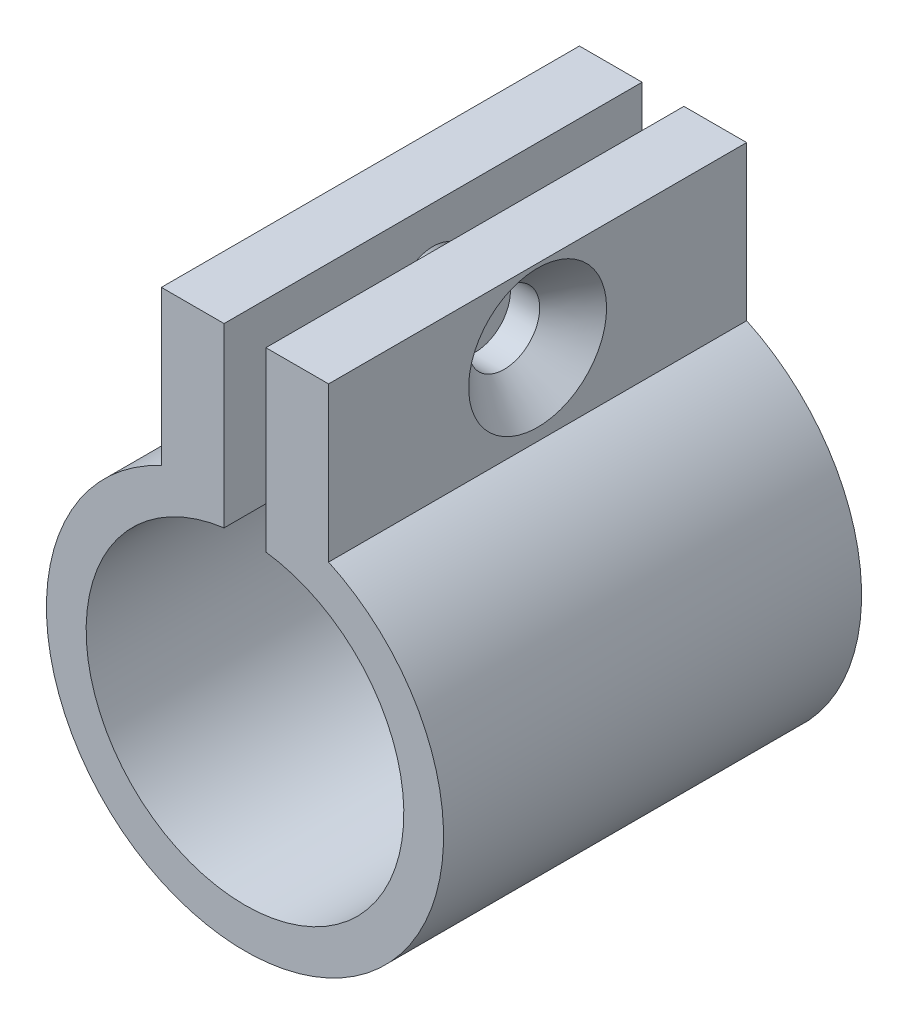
ISO-10303-21;
HEADER;
FILE_DESCRIPTION(('STEP AP214'),'2;1');
FILE_NAME('part.step','',(''),(''),'','','');
FILE_SCHEMA(('AUTOMOTIVE_DESIGN { 1 0 10303 214 1 1 1 1 }'));
ENDSEC;
DATA;
#1=APPLICATION_CONTEXT('core data for automotive mechanical design processes');
#2=APPLICATION_PROTOCOL_DEFINITION('international standard','automotive_design',2000,#1);
#3=PRODUCT_CONTEXT('',#1,'mechanical');
#4=PRODUCT('Part','Part','',(#3));
#5=PRODUCT_RELATED_PRODUCT_CATEGORY('part','',(#4));
#6=PRODUCT_DEFINITION_FORMATION('','',#4);
#7=PRODUCT_DEFINITION_CONTEXT('part definition',#1,'design');
#8=PRODUCT_DEFINITION('design','',#6,#7);
#9=PRODUCT_DEFINITION_SHAPE('','',#8);
#10=(LENGTH_UNIT() NAMED_UNIT(*) SI_UNIT(.MILLI.,.METRE.));
#11=(NAMED_UNIT(*) PLANE_ANGLE_UNIT() SI_UNIT($,.RADIAN.));
#12=(NAMED_UNIT(*) SI_UNIT($,.STERADIAN.) SOLID_ANGLE_UNIT());
#13=UNCERTAINTY_MEASURE_WITH_UNIT(LENGTH_MEASURE(1.E-05),#10,'distance_accuracy_value','');
#14=(GEOMETRIC_REPRESENTATION_CONTEXT(3) GLOBAL_UNCERTAINTY_ASSIGNED_CONTEXT((#13)) GLOBAL_UNIT_ASSIGNED_CONTEXT((#10,
#11,#12)) REPRESENTATION_CONTEXT('',''));
#15=CARTESIAN_POINT('',(0.,0.,0.));
#16=DIRECTION('',(0.,0.,1.));
#17=DIRECTION('',(1.,0.,0.));
#18=AXIS2_PLACEMENT_3D('',#15,#16,#17);
#19=CARTESIAN_POINT('',(0.,0.,20.));
#20=DIRECTION('',(0.,0.,1.));
#21=DIRECTION('',(1.,0.,0.));
#22=AXIS2_PLACEMENT_3D('',#19,#20,#21);
#23=PLANE('',#22);
#24=DIRECTION('',(0.,1.,0.));
#25=VECTOR('',#24,1.);
#26=CARTESIAN_POINT('',(4.,6.4621977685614,20.));
#27=LINE('',#26,#25);
#28=CARTESIAN_POINT('',(4.,8.61684396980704,20.));
#29=VERTEX_POINT('',#28);
#30=CARTESIAN_POINT('',(4.,16.,20.));
#31=VERTEX_POINT('',#30);
#32=EDGE_CURVE('E114',#29,#31,#27,.T.);
#33=ORIENTED_EDGE('',*,*,#32,.T.);
#34=DIRECTION('',(-1.,0.,0.));
#35=VECTOR('',#34,1.);
#36=CARTESIAN_POINT('',(0.,16.,20.));
#37=LINE('',#36,#35);
#38=CARTESIAN_POINT('',(1.,16.,20.));
#39=VERTEX_POINT('',#38);
#40=EDGE_CURVE('E102',#31,#39,#37,.T.);
#41=ORIENTED_EDGE('',*,*,#40,.T.);
#42=DIRECTION('',(0.,1.,0.));
#43=VECTOR('',#42,1.);
#44=CARTESIAN_POINT('',(1.,7.53392328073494,20.));
#45=LINE('',#44,#43);
#46=CARTESIAN_POINT('',(1.,7.53392328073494,20.));
#47=VERTEX_POINT('',#46);
#48=EDGE_CURVE('E111',#47,#39,#45,.T.);
#49=ORIENTED_EDGE('',*,*,#48,.F.);
#50=CARTESIAN_POINT('',(0.,0.,20.));
#51=DIRECTION('',(0.,0.,1.));
#52=DIRECTION('',(1.,0.,0.));
#53=AXIS2_PLACEMENT_3D('',#50,#51,#52);
#54=CIRCLE('',#53,7.6);
#55=CARTESIAN_POINT('',(-1.,7.53392328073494,20.));
#56=VERTEX_POINT('',#55);
#57=EDGE_CURVE('E151',#56,#47,#54,.T.);
#58=ORIENTED_EDGE('',*,*,#57,.F.);
#59=DIRECTION('',(0.,-1.,0.));
#60=VECTOR('',#59,1.);
#61=CARTESIAN_POINT('',(-1.,7.53392328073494,20.));
#62=LINE('',#61,#60);
#63=CARTESIAN_POINT('',(-1.,16.,20.));
#64=VERTEX_POINT('',#63);
#65=EDGE_CURVE('E120',#64,#56,#62,.T.);
#66=ORIENTED_EDGE('',*,*,#65,.F.);
#67=CARTESIAN_POINT('',(-4.,16.,20.));
#68=VERTEX_POINT('',#67);
#69=EDGE_CURVE('E54',#64,#68,#37,.T.);
#70=ORIENTED_EDGE('',*,*,#69,.T.);
#71=DIRECTION('',(0.,-1.,0.));
#72=VECTOR('',#71,1.);
#73=CARTESIAN_POINT('',(-4.,6.46219776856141,20.));
#74=LINE('',#73,#72);
#75=CARTESIAN_POINT('',(-4.,8.61684396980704,20.));
#76=VERTEX_POINT('',#75);
#77=EDGE_CURVE('E140',#68,#76,#74,.T.);
#78=ORIENTED_EDGE('',*,*,#77,.T.);
#79=CARTESIAN_POINT('',(0.,0.,20.));
#80=DIRECTION('',(0.,0.,1.));
#81=DIRECTION('',(1.,0.,0.));
#82=AXIS2_PLACEMENT_3D('',#79,#80,#81);
#83=CIRCLE('',#82,9.5);
#84=EDGE_CURVE('E47',#76,#29,#83,.T.);
#85=ORIENTED_EDGE('',*,*,#84,.T.);
#86=EDGE_LOOP('',(#33,#41,#49,#58,#66,#70,#78,#85));
#87=FACE_BOUND('',#86,.T.);
#88=ADVANCED_FACE('F39',(#87),#23,.T.);
#89=CARTESIAN_POINT('',(0.,0.,0.));
#90=DIRECTION('',(0.,0.,1.));
#91=DIRECTION('',(1.,0.,0.));
#92=AXIS2_PLACEMENT_3D('',#89,#90,#91);
#93=PLANE('',#92);
#94=DIRECTION('',(-1.,0.,0.));
#95=VECTOR('',#94,1.);
#96=CARTESIAN_POINT('',(0.,16.,0.));
#97=LINE('',#96,#95);
#98=CARTESIAN_POINT('',(4.,16.,0.));
#99=VERTEX_POINT('',#98);
#100=CARTESIAN_POINT('',(1.,16.,0.));
#101=VERTEX_POINT('',#100);
#102=EDGE_CURVE('E61',#99,#101,#97,.T.);
#103=ORIENTED_EDGE('',*,*,#102,.F.);
#104=DIRECTION('',(0.,1.,0.));
#105=VECTOR('',#104,1.);
#106=CARTESIAN_POINT('',(4.,6.4621977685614,0.));
#107=LINE('',#106,#105);
#108=CARTESIAN_POINT('',(4.,8.61684396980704,0.));
#109=VERTEX_POINT('',#108);
#110=EDGE_CURVE('E136',#109,#99,#107,.T.);
#111=ORIENTED_EDGE('',*,*,#110,.F.);
#112=CARTESIAN_POINT('',(0.,0.,0.));
#113=DIRECTION('',(0.,0.,1.));
#114=DIRECTION('',(1.,0.,0.));
#115=AXIS2_PLACEMENT_3D('',#112,#113,#114);
#116=CIRCLE('',#115,9.5);
#117=CARTESIAN_POINT('',(-4.,8.61684396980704,0.));
#118=VERTEX_POINT('',#117);
#119=EDGE_CURVE('E153',#118,#109,#116,.T.);
#120=ORIENTED_EDGE('',*,*,#119,.F.);
#121=DIRECTION('',(0.,-1.,0.));
#122=VECTOR('',#121,1.);
#123=CARTESIAN_POINT('',(-4.,6.46219776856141,0.));
#124=LINE('',#123,#122);
#125=CARTESIAN_POINT('',(-4.,16.,0.));
#126=VERTEX_POINT('',#125);
#127=EDGE_CURVE('E139',#126,#118,#124,.T.);
#128=ORIENTED_EDGE('',*,*,#127,.F.);
#129=CARTESIAN_POINT('',(-1.,16.,0.));
#130=VERTEX_POINT('',#129);
#131=EDGE_CURVE('E181',#130,#126,#97,.T.);
#132=ORIENTED_EDGE('',*,*,#131,.F.);
#133=DIRECTION('',(0.,-1.,0.));
#134=VECTOR('',#133,1.);
#135=CARTESIAN_POINT('',(-1.,7.53392328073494,0.));
#136=LINE('',#135,#134);
#137=CARTESIAN_POINT('',(-1.,7.53392328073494,0.));
#138=VERTEX_POINT('',#137);
#139=EDGE_CURVE('E129',#130,#138,#136,.T.);
#140=ORIENTED_EDGE('',*,*,#139,.T.);
#141=CARTESIAN_POINT('',(0.,0.,0.));
#142=DIRECTION('',(0.,0.,1.));
#143=DIRECTION('',(1.,0.,0.));
#144=AXIS2_PLACEMENT_3D('',#141,#142,#143);
#145=CIRCLE('',#144,7.6);
#146=CARTESIAN_POINT('',(1.,7.53392328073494,0.));
#147=VERTEX_POINT('',#146);
#148=EDGE_CURVE('E150',#138,#147,#145,.T.);
#149=ORIENTED_EDGE('',*,*,#148,.T.);
#150=DIRECTION('',(0.,1.,0.));
#151=VECTOR('',#150,1.);
#152=CARTESIAN_POINT('',(1.,7.53392328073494,0.));
#153=LINE('',#152,#151);
#154=EDGE_CURVE('E123',#147,#101,#153,.T.);
#155=ORIENTED_EDGE('',*,*,#154,.T.);
#156=EDGE_LOOP('',(#103,#111,#120,#128,#132,#140,#149,#155));
#157=FACE_BOUND('',#156,.T.);
#158=ADVANCED_FACE('F178',(#157),#93,.F.);
#159=CARTESIAN_POINT('',(4.,6.4621977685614,0.));
#160=DIRECTION('',(1.,0.,0.));
#161=DIRECTION('',(0.,0.,-1.));
#162=AXIS2_PLACEMENT_3D('',#159,#160,#161);
#163=PLANE('',#162);
#164=CARTESIAN_POINT('',(4.,12.5,10.));
#165=DIRECTION('',(1.,0.,0.));
#166=DIRECTION('',(0.,0.,-1.));
#167=AXIS2_PLACEMENT_3D('',#164,#165,#166);
#168=CIRCLE('',#167,3.3);
#169=CARTESIAN_POINT('',(4.,12.5,6.7));
#170=VERTEX_POINT('',#169);
#171=EDGE_CURVE('E166',#170,#170,#168,.T.);
#172=ORIENTED_EDGE('',*,*,#171,.F.);
#173=EDGE_LOOP('',(#172));
#174=FACE_BOUND('',#173,.T.);
#175=ORIENTED_EDGE('',*,*,#110,.T.);
#176=DIRECTION('',(0.,0.,1.));
#177=VECTOR('',#176,1.);
#178=CARTESIAN_POINT('',(4.,16.,0.));
#179=LINE('',#178,#177);
#180=EDGE_CURVE('E115',#99,#31,#179,.T.);
#181=ORIENTED_EDGE('',*,*,#180,.T.);
#182=ORIENTED_EDGE('',*,*,#32,.F.);
#183=DIRECTION('',(0.,0.,-1.));
#184=VECTOR('',#183,1.);
#185=CARTESIAN_POINT('',(4.,8.61684396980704,20.));
#186=LINE('',#185,#184);
#187=EDGE_CURVE('E147',#109,#29,#186,.F.);
#188=ORIENTED_EDGE('',*,*,#187,.F.);
#189=EDGE_LOOP('',(#175,#181,#182,#188));
#190=FACE_BOUND('',#189,.T.);
#191=ADVANCED_FACE('F197',(#174,#190),#163,.T.);
#192=CARTESIAN_POINT('',(-4.,6.46219776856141,0.));
#193=DIRECTION('',(-1.,0.,0.));
#194=DIRECTION('',(0.,-1.,0.));
#195=AXIS2_PLACEMENT_3D('',#192,#193,#194);
#196=PLANE('',#195);
#197=CARTESIAN_POINT('',(-4.,12.5,10.));
#198=DIRECTION('',(-1.,0.,0.));
#199=DIRECTION('',(0.,-1.,0.));
#200=AXIS2_PLACEMENT_3D('',#197,#198,#199);
#201=CIRCLE('',#200,1.7);
#202=CARTESIAN_POINT('',(-4.,10.8,10.));
#203=VERTEX_POINT('',#202);
#204=EDGE_CURVE('E121',#203,#203,#201,.T.);
#205=ORIENTED_EDGE('',*,*,#204,.F.);
#206=EDGE_LOOP('',(#205));
#207=FACE_BOUND('',#206,.T.);
#208=ORIENTED_EDGE('',*,*,#77,.F.);
#209=DIRECTION('',(0.,0.,-1.));
#210=VECTOR('',#209,1.);
#211=CARTESIAN_POINT('',(-4.,16.,0.));
#212=LINE('',#211,#210);
#213=EDGE_CURVE('E171',#68,#126,#212,.T.);
#214=ORIENTED_EDGE('',*,*,#213,.T.);
#215=ORIENTED_EDGE('',*,*,#127,.T.);
#216=DIRECTION('',(0.,0.,-1.));
#217=VECTOR('',#216,1.);
#218=CARTESIAN_POINT('',(-4.,8.61684396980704,20.));
#219=LINE('',#218,#217);
#220=EDGE_CURVE('E142',#76,#118,#219,.T.);
#221=ORIENTED_EDGE('',*,*,#220,.F.);
#222=EDGE_LOOP('',(#208,#214,#215,#221));
#223=FACE_BOUND('',#222,.T.);
#224=ADVANCED_FACE('F191',(#207,#223),#196,.T.);
#225=CARTESIAN_POINT('',(-1.,7.53392328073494,0.));
#226=DIRECTION('',(-1.,0.,0.));
#227=DIRECTION('',(0.,0.,1.));
#228=AXIS2_PLACEMENT_3D('',#225,#226,#227);
#229=PLANE('',#228);
#230=CARTESIAN_POINT('',(-1.,12.5,10.));
#231=DIRECTION('',(-1.,0.,0.));
#232=DIRECTION('',(0.,0.,1.));
#233=AXIS2_PLACEMENT_3D('',#230,#231,#232);
#234=CIRCLE('',#233,1.7);
#235=CARTESIAN_POINT('',(-1.,12.5,11.7));
#236=VERTEX_POINT('',#235);
#237=EDGE_CURVE('E126',#236,#236,#234,.T.);
#238=ORIENTED_EDGE('',*,*,#237,.T.);
#239=EDGE_LOOP('',(#238));
#240=FACE_BOUND('',#239,.T.);
#241=DIRECTION('',(0.,0.,-1.));
#242=VECTOR('',#241,1.);
#243=CARTESIAN_POINT('',(-1.,16.,0.));
#244=LINE('',#243,#242);
#245=EDGE_CURVE('E199',#64,#130,#244,.T.);
#246=ORIENTED_EDGE('',*,*,#245,.F.);
#247=ORIENTED_EDGE('',*,*,#65,.T.);
#248=DIRECTION('',(0.,0.,1.));
#249=VECTOR('',#248,1.);
#250=CARTESIAN_POINT('',(-1.,7.53392328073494,0.));
#251=LINE('',#250,#249);
#252=EDGE_CURVE('E133',#138,#56,#251,.T.);
#253=ORIENTED_EDGE('',*,*,#252,.F.);
#254=ORIENTED_EDGE('',*,*,#139,.F.);
#255=EDGE_LOOP('',(#246,#247,#253,#254));
#256=FACE_BOUND('',#255,.T.);
#257=ADVANCED_FACE('F183',(#240,#256),#229,.F.);
#258=CARTESIAN_POINT('',(1.,7.53392328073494,0.));
#259=DIRECTION('',(1.,0.,0.));
#260=DIRECTION('',(0.,0.,-1.));
#261=AXIS2_PLACEMENT_3D('',#258,#259,#260);
#262=PLANE('',#261);
#263=CARTESIAN_POINT('',(1.,12.5,10.));
#264=DIRECTION('',(1.,0.,0.));
#265=DIRECTION('',(0.,0.,-1.));
#266=AXIS2_PLACEMENT_3D('',#263,#264,#265);
#267=CIRCLE('',#266,1.7);
#268=CARTESIAN_POINT('',(1.,12.5,8.3));
#269=VERTEX_POINT('',#268);
#270=EDGE_CURVE('E158',#269,#269,#267,.T.);
#271=ORIENTED_EDGE('',*,*,#270,.T.);
#272=EDGE_LOOP('',(#271));
#273=FACE_BOUND('',#272,.T.);
#274=DIRECTION('',(0.,0.,1.));
#275=VECTOR('',#274,1.);
#276=CARTESIAN_POINT('',(1.,16.,0.));
#277=LINE('',#276,#275);
#278=EDGE_CURVE('E11',#101,#39,#277,.T.);
#279=ORIENTED_EDGE('',*,*,#278,.F.);
#280=ORIENTED_EDGE('',*,*,#154,.F.);
#281=DIRECTION('',(0.,0.,1.));
#282=VECTOR('',#281,1.);
#283=CARTESIAN_POINT('',(1.,7.53392328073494,0.));
#284=LINE('',#283,#282);
#285=EDGE_CURVE('E119',#147,#47,#284,.T.);
#286=ORIENTED_EDGE('',*,*,#285,.T.);
#287=ORIENTED_EDGE('',*,*,#48,.T.);
#288=EDGE_LOOP('',(#279,#280,#286,#287));
#289=FACE_BOUND('',#288,.T.);
#290=ADVANCED_FACE('F117',(#273,#289),#262,.F.);
#291=CARTESIAN_POINT('',(0.,0.,20.));
#292=DIRECTION('',(0.,0.,-1.));
#293=DIRECTION('',(-1.,0.,0.));
#294=AXIS2_PLACEMENT_3D('',#291,#292,#293);
#295=CYLINDRICAL_SURFACE('',#294,9.5);
#296=ORIENTED_EDGE('',*,*,#119,.T.);
#297=ORIENTED_EDGE('',*,*,#187,.T.);
#298=ORIENTED_EDGE('',*,*,#84,.F.);
#299=ORIENTED_EDGE('',*,*,#220,.T.);
#300=EDGE_LOOP('',(#296,#297,#298,#299));
#301=FACE_BOUND('',#300,.T.);
#302=ADVANCED_FACE('F41',(#301),#295,.T.);
#303=CARTESIAN_POINT('',(0.,0.,20.));
#304=DIRECTION('',(0.,0.,-1.));
#305=DIRECTION('',(-1.,0.,0.));
#306=AXIS2_PLACEMENT_3D('',#303,#304,#305);
#307=CYLINDRICAL_SURFACE('',#306,7.6);
#308=ORIENTED_EDGE('',*,*,#285,.F.);
#309=ORIENTED_EDGE('',*,*,#148,.F.);
#310=ORIENTED_EDGE('',*,*,#252,.T.);
#311=ORIENTED_EDGE('',*,*,#57,.T.);
#312=EDGE_LOOP('',(#308,#309,#310,#311));
#313=FACE_BOUND('',#312,.T.);
#314=ADVANCED_FACE('F186',(#313),#307,.F.);
#315=CARTESIAN_POINT('',(4.,12.5,10.));
#316=DIRECTION('',(1.,0.,0.));
#317=DIRECTION('',(0.,0.,-1.));
#318=AXIS2_PLACEMENT_3D('',#315,#316,#317);
#319=CYLINDRICAL_SURFACE('',#318,1.7);
#320=CARTESIAN_POINT('',(2.4,12.5,10.));
#321=DIRECTION('',(1.,0.,0.));
#322=DIRECTION('',(0.,0.,-1.));
#323=AXIS2_PLACEMENT_3D('',#320,#321,#322);
#324=CIRCLE('',#323,1.7);
#325=CARTESIAN_POINT('',(2.4,12.5,8.3));
#326=VERTEX_POINT('',#325);
#327=EDGE_CURVE('E160',#326,#326,#324,.T.);
#328=ORIENTED_EDGE('',*,*,#327,.T.);
#329=EDGE_LOOP('',(#328));
#330=FACE_BOUND('',#329,.T.);
#331=ORIENTED_EDGE('',*,*,#270,.F.);
#332=EDGE_LOOP('',(#331));
#333=FACE_BOUND('',#332,.T.);
#334=ADVANCED_FACE('F218',(#330,#333),#319,.F.);
#335=CARTESIAN_POINT('',(4.,12.5,10.));
#336=DIRECTION('',(1.,0.,0.));
#337=DIRECTION('',(0.,0.,-1.));
#338=AXIS2_PLACEMENT_3D('',#335,#336,#337);
#339=CONICAL_SURFACE('',#338,3.3,0.785398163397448);
#340=ORIENTED_EDGE('',*,*,#327,.F.);
#341=EDGE_LOOP('',(#340));
#342=FACE_BOUND('',#341,.T.);
#343=ORIENTED_EDGE('',*,*,#171,.T.);
#344=EDGE_LOOP('',(#343));
#345=FACE_BOUND('',#344,.T.);
#346=ADVANCED_FACE('F231',(#342,#345),#339,.F.);
#347=ORIENTED_EDGE('',*,*,#204,.T.);
#348=EDGE_LOOP('',(#347));
#349=FACE_BOUND('',#348,.T.);
#350=ORIENTED_EDGE('',*,*,#237,.F.);
#351=EDGE_LOOP('',(#350));
#352=FACE_BOUND('',#351,.T.);
#353=ADVANCED_FACE('F208',(#349,#352),#319,.F.);
#354=CARTESIAN_POINT('',(0.,16.,0.));
#355=DIRECTION('',(0.,1.,0.));
#356=DIRECTION('',(0.,0.,1.));
#357=AXIS2_PLACEMENT_3D('',#354,#355,#356);
#358=PLANE('',#357);
#359=ORIENTED_EDGE('',*,*,#102,.T.);
#360=ORIENTED_EDGE('',*,*,#278,.T.);
#361=ORIENTED_EDGE('',*,*,#40,.F.);
#362=ORIENTED_EDGE('',*,*,#180,.F.);
#363=EDGE_LOOP('',(#359,#360,#361,#362));
#364=FACE_BOUND('',#363,.T.);
#365=ADVANCED_FACE('F101',(#364),#358,.T.);
#366=ORIENTED_EDGE('',*,*,#69,.F.);
#367=ORIENTED_EDGE('',*,*,#245,.T.);
#368=ORIENTED_EDGE('',*,*,#131,.T.);
#369=ORIENTED_EDGE('',*,*,#213,.F.);
#370=EDGE_LOOP('',(#366,#367,#368,#369));
#371=FACE_BOUND('',#370,.T.);
#372=ADVANCED_FACE('F202',(#371),#358,.T.);
#373=CLOSED_SHELL('',(#88,#158,#191,#224,#257,#290,#302,#314,#334,#346,#353,#365,#372));
#374=MANIFOLD_SOLID_BREP('B2',#373);
#375=ADVANCED_BREP_SHAPE_REPRESENTATION('',(#18,#374),#14);
#376=SHAPE_DEFINITION_REPRESENTATION(#9,#375);
ENDSEC;
END-ISO-10303-21;
